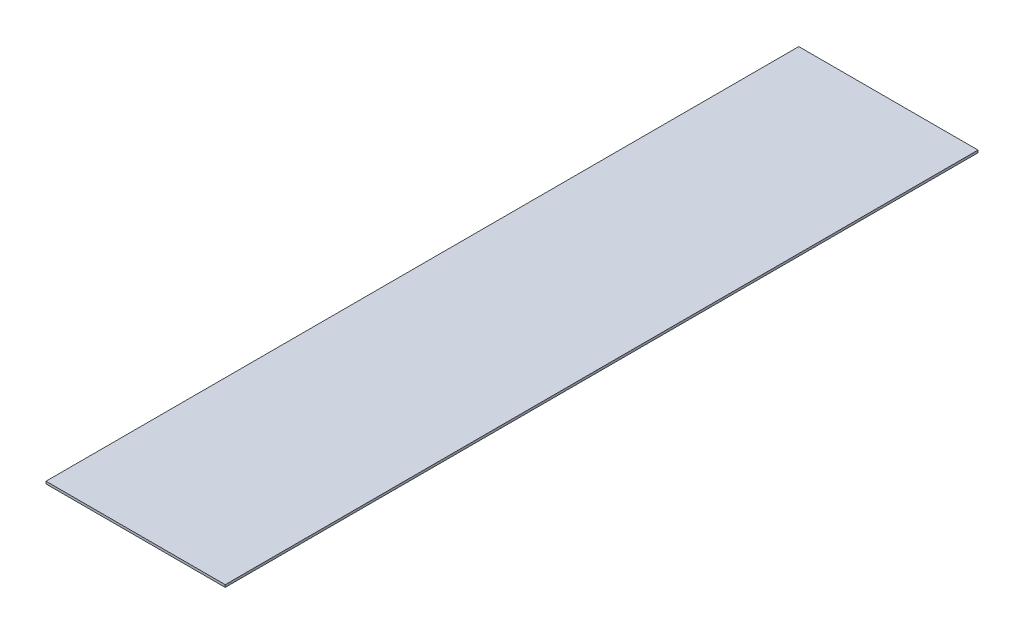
ISO-10303-21;
HEADER;
FILE_DESCRIPTION(('STEP AP214'),'2;1');
FILE_NAME('part.step','',(''),(''),'','','');
FILE_SCHEMA(('AUTOMOTIVE_DESIGN { 1 0 10303 214 1 1 1 1 }'));
ENDSEC;
DATA;
#1=APPLICATION_CONTEXT('core data for automotive mechanical design processes');
#2=APPLICATION_PROTOCOL_DEFINITION('international standard','automotive_design',2000,#1);
#3=PRODUCT_CONTEXT('',#1,'mechanical');
#4=PRODUCT('Part','Part','',(#3));
#5=PRODUCT_RELATED_PRODUCT_CATEGORY('part','',(#4));
#6=PRODUCT_DEFINITION_FORMATION('','',#4);
#7=PRODUCT_DEFINITION_CONTEXT('part definition',#1,'design');
#8=PRODUCT_DEFINITION('design','',#6,#7);
#9=PRODUCT_DEFINITION_SHAPE('','',#8);
#10=(LENGTH_UNIT() NAMED_UNIT(*) SI_UNIT(.MILLI.,.METRE.));
#11=(NAMED_UNIT(*) PLANE_ANGLE_UNIT() SI_UNIT($,.RADIAN.));
#12=(NAMED_UNIT(*) SI_UNIT($,.STERADIAN.) SOLID_ANGLE_UNIT());
#13=UNCERTAINTY_MEASURE_WITH_UNIT(LENGTH_MEASURE(1.E-05),#10,'distance_accuracy_value','');
#14=(GEOMETRIC_REPRESENTATION_CONTEXT(3) GLOBAL_UNCERTAINTY_ASSIGNED_CONTEXT((#13)) GLOBAL_UNIT_ASSIGNED_CONTEXT((#10,
#11,#12)) REPRESENTATION_CONTEXT('',''));
#15=CARTESIAN_POINT('',(0.,0.,0.));
#16=DIRECTION('',(0.,0.,1.));
#17=DIRECTION('',(1.,0.,0.));
#18=AXIS2_PLACEMENT_3D('',#15,#16,#17);
#19=CARTESIAN_POINT('',(-3.29971020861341,0.1016,14.1102393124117));
#20=DIRECTION('',(0.,0.,-1.));
#21=DIRECTION('',(-1.,0.,0.));
#22=AXIS2_PLACEMENT_3D('',#19,#20,#21);
#23=PLANE('',#22);
#24=DIRECTION('',(1.,0.,0.));
#25=VECTOR('',#24,1.);
#26=CARTESIAN_POINT('',(-3.29971020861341,0.,14.1102393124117));
#27=LINE('',#26,#25);
#28=CARTESIAN_POINT('',(-3.29971020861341,0.,14.1102393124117));
#29=VERTEX_POINT('',#28);
#30=CARTESIAN_POINT('',(4.31967459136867,0.,14.1102393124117));
#31=VERTEX_POINT('',#30);
#32=EDGE_CURVE('E93',#29,#31,#27,.T.);
#33=ORIENTED_EDGE('',*,*,#32,.T.);
#34=DIRECTION('',(0.,-1.,0.));
#35=VECTOR('',#34,1.);
#36=CARTESIAN_POINT('',(4.31967459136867,0.1016,14.1102393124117));
#37=LINE('',#36,#35);
#38=CARTESIAN_POINT('',(4.31967459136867,0.1016,14.1102393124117));
#39=VERTEX_POINT('',#38);
#40=EDGE_CURVE('E11',#39,#31,#37,.T.);
#41=ORIENTED_EDGE('',*,*,#40,.F.);
#42=DIRECTION('',(1.,0.,0.));
#43=VECTOR('',#42,1.);
#44=CARTESIAN_POINT('',(-3.29971020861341,0.1016,14.1102393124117));
#45=LINE('',#44,#43);
#46=CARTESIAN_POINT('',(-3.29971020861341,0.1016,14.1102393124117));
#47=VERTEX_POINT('',#46);
#48=EDGE_CURVE('E81',#47,#39,#45,.T.);
#49=ORIENTED_EDGE('',*,*,#48,.F.);
#50=DIRECTION('',(0.,-1.,0.));
#51=VECTOR('',#50,1.);
#52=CARTESIAN_POINT('',(-3.29971020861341,0.1016,14.1102393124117));
#53=LINE('',#52,#51);
#54=EDGE_CURVE('E89',#47,#29,#53,.T.);
#55=ORIENTED_EDGE('',*,*,#54,.T.);
#56=EDGE_LOOP('',(#33,#41,#49,#55));
#57=FACE_BOUND('',#56,.T.);
#58=ADVANCED_FACE('F30',(#57),#23,.F.);
#59=CARTESIAN_POINT('',(4.31967459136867,0.1016,-17.8937606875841));
#60=DIRECTION('',(-1.,0.,0.));
#61=DIRECTION('',(0.,0.,1.));
#62=AXIS2_PLACEMENT_3D('',#59,#60,#61);
#63=PLANE('',#62);
#64=DIRECTION('',(0.,0.,-1.));
#65=VECTOR('',#64,1.);
#66=CARTESIAN_POINT('',(4.31967459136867,0.,-17.8937606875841));
#67=LINE('',#66,#65);
#68=CARTESIAN_POINT('',(4.31967459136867,0.,-17.8937606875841));
#69=VERTEX_POINT('',#68);
#70=EDGE_CURVE('E85',#31,#69,#67,.T.);
#71=ORIENTED_EDGE('',*,*,#70,.T.);
#72=DIRECTION('',(0.,-1.,0.));
#73=VECTOR('',#72,1.);
#74=CARTESIAN_POINT('',(4.31967459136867,0.1016,-17.8937606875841));
#75=LINE('',#74,#73);
#76=CARTESIAN_POINT('',(4.31967459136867,0.1016,-17.8937606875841));
#77=VERTEX_POINT('',#76);
#78=EDGE_CURVE('E38',#77,#69,#75,.T.);
#79=ORIENTED_EDGE('',*,*,#78,.F.);
#80=DIRECTION('',(0.,0.,-1.));
#81=VECTOR('',#80,1.);
#82=CARTESIAN_POINT('',(4.31967459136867,0.1016,-17.8937606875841));
#83=LINE('',#82,#81);
#84=EDGE_CURVE('E76',#39,#77,#83,.T.);
#85=ORIENTED_EDGE('',*,*,#84,.F.);
#86=ORIENTED_EDGE('',*,*,#40,.T.);
#87=EDGE_LOOP('',(#71,#79,#85,#86));
#88=FACE_BOUND('',#87,.T.);
#89=ADVANCED_FACE('F84',(#88),#63,.F.);
#90=CARTESIAN_POINT('',(-3.29971020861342,0.1016,-17.8937606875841));
#91=DIRECTION('',(0.,0.,1.));
#92=DIRECTION('',(1.,0.,0.));
#93=AXIS2_PLACEMENT_3D('',#90,#91,#92);
#94=PLANE('',#93);
#95=DIRECTION('',(-1.,0.,0.));
#96=VECTOR('',#95,1.);
#97=CARTESIAN_POINT('',(-3.29971020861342,0.,-17.8937606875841));
#98=LINE('',#97,#96);
#99=CARTESIAN_POINT('',(-3.29971020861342,0.,-17.8937606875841));
#100=VERTEX_POINT('',#99);
#101=EDGE_CURVE('E63',#69,#100,#98,.T.);
#102=ORIENTED_EDGE('',*,*,#101,.T.);
#103=DIRECTION('',(0.,-1.,0.));
#104=VECTOR('',#103,1.);
#105=CARTESIAN_POINT('',(-3.29971020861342,0.1016,-17.8937606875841));
#106=LINE('',#105,#104);
#107=CARTESIAN_POINT('',(-3.29971020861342,0.1016,-17.8937606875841));
#108=VERTEX_POINT('',#107);
#109=EDGE_CURVE('E86',#108,#100,#106,.T.);
#110=ORIENTED_EDGE('',*,*,#109,.F.);
#111=DIRECTION('',(-1.,0.,0.));
#112=VECTOR('',#111,1.);
#113=CARTESIAN_POINT('',(-3.29971020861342,0.1016,-17.8937606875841));
#114=LINE('',#113,#112);
#115=EDGE_CURVE('E79',#77,#108,#114,.T.);
#116=ORIENTED_EDGE('',*,*,#115,.F.);
#117=ORIENTED_EDGE('',*,*,#78,.T.);
#118=EDGE_LOOP('',(#102,#110,#116,#117));
#119=FACE_BOUND('',#118,.T.);
#120=ADVANCED_FACE('F87',(#119),#94,.F.);
#121=CARTESIAN_POINT('',(-3.29971020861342,0.1016,-17.8937606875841));
#122=DIRECTION('',(1.,0.,0.));
#123=DIRECTION('',(0.,0.,-1.));
#124=AXIS2_PLACEMENT_3D('',#121,#122,#123);
#125=PLANE('',#124);
#126=DIRECTION('',(0.,0.,1.));
#127=VECTOR('',#126,1.);
#128=CARTESIAN_POINT('',(-3.29971020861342,0.,-17.8937606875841));
#129=LINE('',#128,#127);
#130=EDGE_CURVE('E69',#100,#29,#129,.T.);
#131=ORIENTED_EDGE('',*,*,#130,.T.);
#132=ORIENTED_EDGE('',*,*,#54,.F.);
#133=DIRECTION('',(0.,0.,1.));
#134=VECTOR('',#133,1.);
#135=CARTESIAN_POINT('',(-3.29971020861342,0.1016,-17.8937606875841));
#136=LINE('',#135,#134);
#137=EDGE_CURVE('E46',#108,#47,#136,.T.);
#138=ORIENTED_EDGE('',*,*,#137,.F.);
#139=ORIENTED_EDGE('',*,*,#109,.T.);
#140=EDGE_LOOP('',(#131,#132,#138,#139));
#141=FACE_BOUND('',#140,.T.);
#142=ADVANCED_FACE('F100',(#141),#125,.F.);
#143=CARTESIAN_POINT('',(4.31967459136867,0.1016,14.1102393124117));
#144=DIRECTION('',(0.,-1.,0.));
#145=DIRECTION('',(0.,0.,-1.));
#146=AXIS2_PLACEMENT_3D('',#143,#144,#145);
#147=PLANE('',#146);
#148=ORIENTED_EDGE('',*,*,#48,.T.);
#149=ORIENTED_EDGE('',*,*,#84,.T.);
#150=ORIENTED_EDGE('',*,*,#115,.T.);
#151=ORIENTED_EDGE('',*,*,#137,.T.);
#152=EDGE_LOOP('',(#148,#149,#150,#151));
#153=FACE_BOUND('',#152,.T.);
#154=ADVANCED_FACE('F77',(#153),#147,.F.);
#155=CARTESIAN_POINT('',(4.31967459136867,0.,14.1102393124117));
#156=DIRECTION('',(0.,-1.,0.));
#157=DIRECTION('',(0.,0.,-1.));
#158=AXIS2_PLACEMENT_3D('',#155,#156,#157);
#159=PLANE('',#158);
#160=ORIENTED_EDGE('',*,*,#32,.F.);
#161=ORIENTED_EDGE('',*,*,#130,.F.);
#162=ORIENTED_EDGE('',*,*,#101,.F.);
#163=ORIENTED_EDGE('',*,*,#70,.F.);
#164=EDGE_LOOP('',(#160,#161,#162,#163));
#165=FACE_BOUND('',#164,.T.);
#166=ADVANCED_FACE('F103',(#165),#159,.T.);
#167=CLOSED_SHELL('',(#58,#89,#120,#142,#154,#166));
#168=MANIFOLD_SOLID_BREP('B2',#167);
#169=ADVANCED_BREP_SHAPE_REPRESENTATION('',(#18,#168),#14);
#170=SHAPE_DEFINITION_REPRESENTATION(#9,#169);
ENDSEC;
END-ISO-10303-21;
